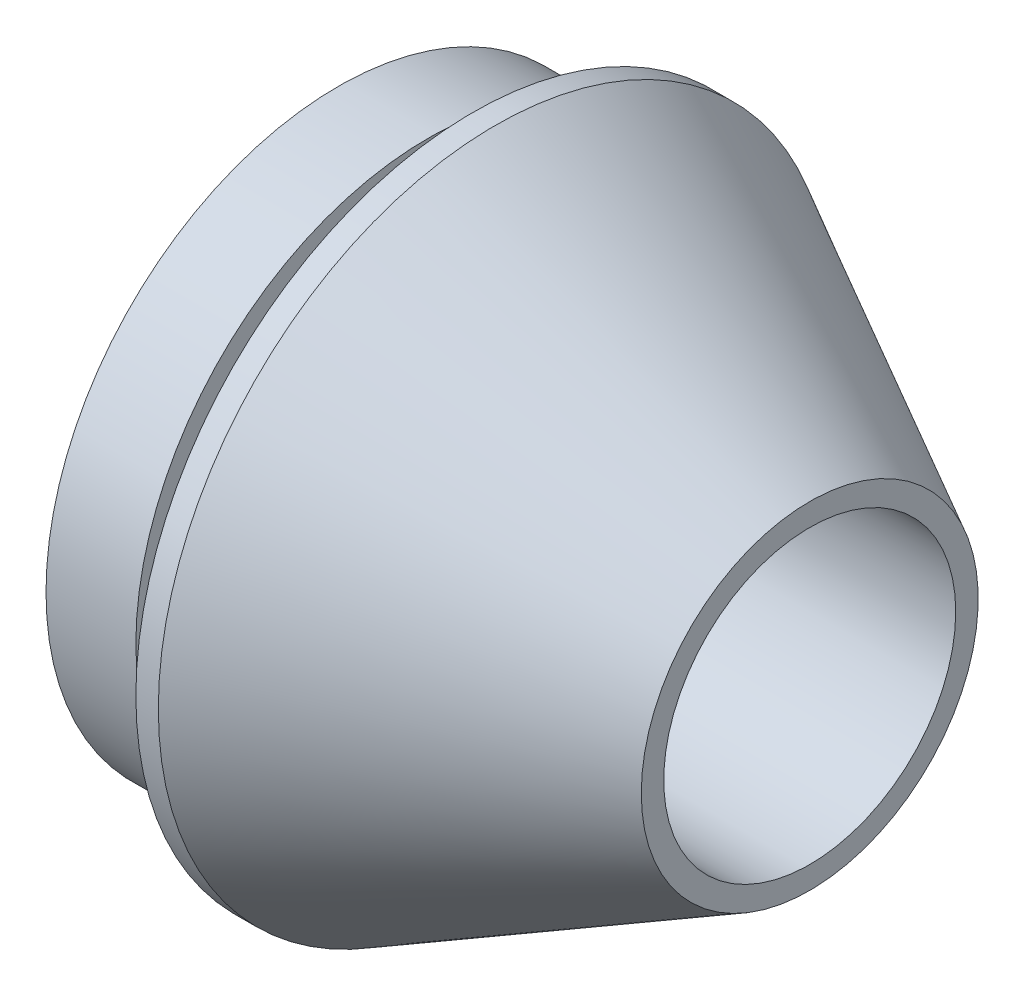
ISO-10303-21;
HEADER;
FILE_DESCRIPTION(('STEP AP214'),'2;1');
FILE_NAME('part.step','',(''),(''),'','','');
FILE_SCHEMA(('AUTOMOTIVE_DESIGN { 1 0 10303 214 1 1 1 1 }'));
ENDSEC;
DATA;
#1=APPLICATION_CONTEXT('core data for automotive mechanical design processes');
#2=APPLICATION_PROTOCOL_DEFINITION('international standard','automotive_design',2000,#1);
#3=PRODUCT_CONTEXT('',#1,'mechanical');
#4=PRODUCT('Part','Part','',(#3));
#5=PRODUCT_RELATED_PRODUCT_CATEGORY('part','',(#4));
#6=PRODUCT_DEFINITION_FORMATION('','',#4);
#7=PRODUCT_DEFINITION_CONTEXT('part definition',#1,'design');
#8=PRODUCT_DEFINITION('design','',#6,#7);
#9=PRODUCT_DEFINITION_SHAPE('','',#8);
#10=(LENGTH_UNIT() NAMED_UNIT(*) SI_UNIT(.MILLI.,.METRE.));
#11=(NAMED_UNIT(*) PLANE_ANGLE_UNIT() SI_UNIT($,.RADIAN.));
#12=(NAMED_UNIT(*) SI_UNIT($,.STERADIAN.) SOLID_ANGLE_UNIT());
#13=UNCERTAINTY_MEASURE_WITH_UNIT(LENGTH_MEASURE(1.E-05),#10,'distance_accuracy_value','');
#14=(GEOMETRIC_REPRESENTATION_CONTEXT(3) GLOBAL_UNCERTAINTY_ASSIGNED_CONTEXT((#13)) GLOBAL_UNIT_ASSIGNED_CONTEXT((#10,
#11,#12)) REPRESENTATION_CONTEXT('',''));
#15=CARTESIAN_POINT('',(0.,0.,0.));
#16=DIRECTION('',(0.,0.,1.));
#17=DIRECTION('',(1.,0.,0.));
#18=AXIS2_PLACEMENT_3D('',#15,#16,#17);
#19=CARTESIAN_POINT('',(21.,0.,0.));
#20=DIRECTION('',(-1.,0.,0.));
#21=DIRECTION('',(0.,0.,1.));
#22=AXIS2_PLACEMENT_3D('',#19,#20,#21);
#23=PLANE('',#22);
#24=CARTESIAN_POINT('',(21.,0.,0.));
#25=DIRECTION('',(1.,0.,0.));
#26=DIRECTION('',(0.,0.,-1.));
#27=AXIS2_PLACEMENT_3D('',#24,#25,#26);
#28=CIRCLE('',#27,6.5);
#29=CARTESIAN_POINT('',(21.,0.,-6.5));
#30=VERTEX_POINT('',#29);
#31=EDGE_CURVE('E61',#30,#30,#28,.T.);
#32=ORIENTED_EDGE('',*,*,#31,.F.);
#33=EDGE_LOOP('',(#32));
#34=FACE_BOUND('',#33,.T.);
#35=CARTESIAN_POINT('',(21.,0.,0.));
#36=DIRECTION('',(-1.,0.,0.));
#37=DIRECTION('',(0.,0.,1.));
#38=AXIS2_PLACEMENT_3D('',#35,#36,#37);
#39=CIRCLE('',#38,7.5);
#40=CARTESIAN_POINT('',(21.,0.,7.5));
#41=VERTEX_POINT('',#40);
#42=EDGE_CURVE('E10',#41,#41,#39,.T.);
#43=ORIENTED_EDGE('',*,*,#42,.F.);
#44=EDGE_LOOP('',(#43));
#45=FACE_BOUND('',#44,.T.);
#46=ADVANCED_FACE('F32',(#34,#45),#23,.F.);
#47=CARTESIAN_POINT('',(21.,0.,0.));
#48=DIRECTION('',(-1.,0.,0.));
#49=DIRECTION('',(0.,0.,1.));
#50=AXIS2_PLACEMENT_3D('',#47,#48,#49);
#51=CONICAL_SURFACE('',#50,7.5,0.491809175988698);
#52=CARTESIAN_POINT('',(7.,0.,0.));
#53=DIRECTION('',(-1.,0.,0.));
#54=DIRECTION('',(0.,0.,1.));
#55=AXIS2_PLACEMENT_3D('',#52,#53,#54);
#56=CIRCLE('',#55,15.);
#57=CARTESIAN_POINT('',(7.,0.,15.));
#58=VERTEX_POINT('',#57);
#59=EDGE_CURVE('E38',#58,#58,#56,.T.);
#60=ORIENTED_EDGE('',*,*,#59,.F.);
#61=EDGE_LOOP('',(#60));
#62=FACE_BOUND('',#61,.T.);
#63=ORIENTED_EDGE('',*,*,#42,.T.);
#64=EDGE_LOOP('',(#63));
#65=FACE_BOUND('',#64,.T.);
#66=ADVANCED_FACE('F78',(#62,#65),#51,.T.);
#67=CARTESIAN_POINT('',(0.,0.,0.));
#68=DIRECTION('',(-1.,0.,0.));
#69=DIRECTION('',(0.,0.,1.));
#70=AXIS2_PLACEMENT_3D('',#67,#68,#69);
#71=CYLINDRICAL_SURFACE('',#70,15.);
#72=CARTESIAN_POINT('',(6.,0.,0.));
#73=DIRECTION('',(-1.,0.,0.));
#74=DIRECTION('',(0.,0.,1.));
#75=AXIS2_PLACEMENT_3D('',#72,#73,#74);
#76=CIRCLE('',#75,15.);
#77=CARTESIAN_POINT('',(6.,0.,15.));
#78=VERTEX_POINT('',#77);
#79=EDGE_CURVE('E42',#78,#78,#76,.T.);
#80=ORIENTED_EDGE('',*,*,#79,.F.);
#81=EDGE_LOOP('',(#80));
#82=FACE_BOUND('',#81,.T.);
#83=ORIENTED_EDGE('',*,*,#59,.T.);
#84=EDGE_LOOP('',(#83));
#85=FACE_BOUND('',#84,.T.);
#86=ADVANCED_FACE('F82',(#82,#85),#71,.T.);
#87=CARTESIAN_POINT('',(6.,15.,0.));
#88=DIRECTION('',(1.,0.,0.));
#89=DIRECTION('',(0.,0.,-1.));
#90=AXIS2_PLACEMENT_3D('',#87,#88,#89);
#91=PLANE('',#90);
#92=CARTESIAN_POINT('',(6.,0.,0.));
#93=DIRECTION('',(-1.,0.,0.));
#94=DIRECTION('',(0.,0.,1.));
#95=AXIS2_PLACEMENT_3D('',#92,#93,#94);
#96=CIRCLE('',#95,12.);
#97=CARTESIAN_POINT('',(6.,0.,12.));
#98=VERTEX_POINT('',#97);
#99=EDGE_CURVE('E46',#98,#98,#96,.T.);
#100=ORIENTED_EDGE('',*,*,#99,.F.);
#101=EDGE_LOOP('',(#100));
#102=FACE_BOUND('',#101,.T.);
#103=ORIENTED_EDGE('',*,*,#79,.T.);
#104=EDGE_LOOP('',(#103));
#105=FACE_BOUND('',#104,.T.);
#106=ADVANCED_FACE('F87',(#102,#105),#91,.F.);
#107=CARTESIAN_POINT('',(0.,0.,0.));
#108=DIRECTION('',(-1.,0.,0.));
#109=DIRECTION('',(0.,0.,1.));
#110=AXIS2_PLACEMENT_3D('',#107,#108,#109);
#111=CYLINDRICAL_SURFACE('',#110,12.);
#112=CARTESIAN_POINT('',(4.,0.,0.));
#113=DIRECTION('',(-1.,0.,0.));
#114=DIRECTION('',(0.,0.,1.));
#115=AXIS2_PLACEMENT_3D('',#112,#113,#114);
#116=CIRCLE('',#115,12.);
#117=CARTESIAN_POINT('',(4.,0.,12.));
#118=VERTEX_POINT('',#117);
#119=EDGE_CURVE('E51',#118,#118,#116,.T.);
#120=ORIENTED_EDGE('',*,*,#119,.F.);
#121=EDGE_LOOP('',(#120));
#122=FACE_BOUND('',#121,.T.);
#123=ORIENTED_EDGE('',*,*,#99,.T.);
#124=EDGE_LOOP('',(#123));
#125=FACE_BOUND('',#124,.T.);
#126=ADVANCED_FACE('F93',(#122,#125),#111,.T.);
#127=CARTESIAN_POINT('',(4.,13.,0.));
#128=DIRECTION('',(-1.,0.,0.));
#129=DIRECTION('',(0.,0.,1.));
#130=AXIS2_PLACEMENT_3D('',#127,#128,#129);
#131=PLANE('',#130);
#132=CARTESIAN_POINT('',(4.,0.,0.));
#133=DIRECTION('',(-1.,0.,0.));
#134=DIRECTION('',(0.,0.,1.));
#135=AXIS2_PLACEMENT_3D('',#132,#133,#134);
#136=CIRCLE('',#135,13.);
#137=CARTESIAN_POINT('',(4.,0.,13.));
#138=VERTEX_POINT('',#137);
#139=EDGE_CURVE('E54',#138,#138,#136,.T.);
#140=ORIENTED_EDGE('',*,*,#139,.F.);
#141=EDGE_LOOP('',(#140));
#142=FACE_BOUND('',#141,.T.);
#143=ORIENTED_EDGE('',*,*,#119,.T.);
#144=EDGE_LOOP('',(#143));
#145=FACE_BOUND('',#144,.T.);
#146=ADVANCED_FACE('F97',(#142,#145),#131,.F.);
#147=CARTESIAN_POINT('',(0.,0.,0.));
#148=DIRECTION('',(-1.,0.,0.));
#149=DIRECTION('',(0.,0.,1.));
#150=AXIS2_PLACEMENT_3D('',#147,#148,#149);
#151=CYLINDRICAL_SURFACE('',#150,13.);
#152=CARTESIAN_POINT('',(0.,0.,0.));
#153=DIRECTION('',(-1.,0.,0.));
#154=DIRECTION('',(0.,0.,1.));
#155=AXIS2_PLACEMENT_3D('',#152,#153,#154);
#156=CIRCLE('',#155,13.);
#157=CARTESIAN_POINT('',(0.,0.,13.));
#158=VERTEX_POINT('',#157);
#159=EDGE_CURVE('E57',#158,#158,#156,.T.);
#160=ORIENTED_EDGE('',*,*,#159,.F.);
#161=EDGE_LOOP('',(#160));
#162=FACE_BOUND('',#161,.T.);
#163=ORIENTED_EDGE('',*,*,#139,.T.);
#164=EDGE_LOOP('',(#163));
#165=FACE_BOUND('',#164,.T.);
#166=ADVANCED_FACE('F101',(#162,#165),#151,.T.);
#167=CARTESIAN_POINT('',(0.,0.,0.));
#168=DIRECTION('',(1.,0.,0.));
#169=DIRECTION('',(0.,0.,-1.));
#170=AXIS2_PLACEMENT_3D('',#167,#168,#169);
#171=PLANE('',#170);
#172=CARTESIAN_POINT('',(0.,0.,0.));
#173=DIRECTION('',(1.,0.,0.));
#174=DIRECTION('',(0.,0.,-1.));
#175=AXIS2_PLACEMENT_3D('',#172,#173,#174);
#176=CIRCLE('',#175,6.5);
#177=CARTESIAN_POINT('',(0.,0.,-6.5));
#178=VERTEX_POINT('',#177);
#179=EDGE_CURVE('E60',#178,#178,#176,.T.);
#180=ORIENTED_EDGE('',*,*,#179,.T.);
#181=EDGE_LOOP('',(#180));
#182=FACE_BOUND('',#181,.T.);
#183=ORIENTED_EDGE('',*,*,#159,.T.);
#184=EDGE_LOOP('',(#183));
#185=FACE_BOUND('',#184,.T.);
#186=ADVANCED_FACE('F67',(#182,#185),#171,.F.);
#187=CARTESIAN_POINT('',(0.,0.,0.));
#188=DIRECTION('',(1.,0.,0.));
#189=DIRECTION('',(0.,0.,-1.));
#190=AXIS2_PLACEMENT_3D('',#187,#188,#189);
#191=CYLINDRICAL_SURFACE('',#190,6.5);
#192=CARTESIAN_POINT('',(0.,0.,-6.5));
#193=CARTESIAN_POINT('',(0.21875,0.,-6.5));
#194=CARTESIAN_POINT('',(0.4375,0.,-6.5));
#195=CARTESIAN_POINT('',(0.875,0.,-6.5));
#196=CARTESIAN_POINT('',(1.09375,0.,-6.5));
#197=CARTESIAN_POINT('',(1.53125,0.,-6.5));
#198=CARTESIAN_POINT('',(1.75,0.,-6.5));
#199=CARTESIAN_POINT('',(2.1875,0.,-6.5));
#200=CARTESIAN_POINT('',(2.40625,0.,-6.5));
#201=CARTESIAN_POINT('',(2.84375,0.,-6.5));
#202=CARTESIAN_POINT('',(3.0625,0.,-6.5));
#203=CARTESIAN_POINT('',(3.5,0.,-6.5));
#204=CARTESIAN_POINT('',(3.71875,0.,-6.5));
#205=CARTESIAN_POINT('',(4.15625,0.,-6.5));
#206=CARTESIAN_POINT('',(4.375,0.,-6.5));
#207=CARTESIAN_POINT('',(4.8125,0.,-6.5));
#208=CARTESIAN_POINT('',(5.03125,0.,-6.5));
#209=CARTESIAN_POINT('',(5.46875,0.,-6.5));
#210=CARTESIAN_POINT('',(5.6875,0.,-6.5));
#211=CARTESIAN_POINT('',(6.125,0.,-6.5));
#212=CARTESIAN_POINT('',(6.34375,0.,-6.5));
#213=CARTESIAN_POINT('',(6.78125,0.,-6.5));
#214=CARTESIAN_POINT('',(7.,0.,-6.5));
#215=CARTESIAN_POINT('',(7.4375,0.,-6.5));
#216=CARTESIAN_POINT('',(7.65625,0.,-6.5));
#217=CARTESIAN_POINT('',(8.09375,0.,-6.5));
#218=CARTESIAN_POINT('',(8.3125,0.,-6.5));
#219=CARTESIAN_POINT('',(8.75,0.,-6.5));
#220=CARTESIAN_POINT('',(8.96875,0.,-6.5));
#221=CARTESIAN_POINT('',(9.40625,0.,-6.5));
#222=CARTESIAN_POINT('',(9.625,0.,-6.5));
#223=CARTESIAN_POINT('',(10.0625,0.,-6.5));
#224=CARTESIAN_POINT('',(10.28125,0.,-6.5));
#225=CARTESIAN_POINT('',(10.71875,0.,-6.5));
#226=CARTESIAN_POINT('',(10.9375,0.,-6.5));
#227=CARTESIAN_POINT('',(11.375,0.,-6.5));
#228=CARTESIAN_POINT('',(11.59375,0.,-6.5));
#229=CARTESIAN_POINT('',(12.03125,0.,-6.5));
#230=CARTESIAN_POINT('',(12.25,0.,-6.5));
#231=CARTESIAN_POINT('',(12.6875,0.,-6.5));
#232=CARTESIAN_POINT('',(12.90625,0.,-6.5));
#233=CARTESIAN_POINT('',(13.34375,0.,-6.5));
#234=CARTESIAN_POINT('',(13.5625,0.,-6.5));
#235=CARTESIAN_POINT('',(14.,0.,-6.5));
#236=CARTESIAN_POINT('',(14.21875,0.,-6.5));
#237=CARTESIAN_POINT('',(14.65625,0.,-6.5));
#238=CARTESIAN_POINT('',(14.875,0.,-6.5));
#239=CARTESIAN_POINT('',(15.3125,0.,-6.5));
#240=CARTESIAN_POINT('',(15.53125,0.,-6.5));
#241=CARTESIAN_POINT('',(15.96875,0.,-6.5));
#242=CARTESIAN_POINT('',(16.1875,0.,-6.5));
#243=CARTESIAN_POINT('',(16.625,0.,-6.5));
#244=CARTESIAN_POINT('',(16.84375,0.,-6.5));
#245=CARTESIAN_POINT('',(17.28125,0.,-6.5));
#246=CARTESIAN_POINT('',(17.5,0.,-6.5));
#247=CARTESIAN_POINT('',(17.9375,0.,-6.5));
#248=CARTESIAN_POINT('',(18.15625,0.,-6.5));
#249=CARTESIAN_POINT('',(18.59375,0.,-6.5));
#250=CARTESIAN_POINT('',(18.8125,0.,-6.5));
#251=CARTESIAN_POINT('',(19.25,0.,-6.5));
#252=CARTESIAN_POINT('',(19.46875,0.,-6.5));
#253=CARTESIAN_POINT('',(19.90625,0.,-6.5));
#254=CARTESIAN_POINT('',(20.125,0.,-6.5));
#255=CARTESIAN_POINT('',(20.5625,0.,-6.5));
#256=CARTESIAN_POINT('',(20.78125,0.,-6.5));
#257=CARTESIAN_POINT('',(21.,0.,-6.5));
#258=B_SPLINE_CURVE_WITH_KNOTS('',3,(#192,#193,#194,#195,#196,#197,#198,#199,#200,#201,#202,
#203,#204,#205,#206,#207,#208,#209,#210,#211,#212,#213,#214,#215,#216,#217,#218,#219,#220,#221,
#222,#223,#224,#225,#226,#227,#228,#229,#230,#231,#232,#233,#234,#235,#236,#237,#238,#239,#240,
#241,#242,#243,#244,#245,#246,#247,#248,#249,#250,#251,#252,#253,#254,#255,#256,#257),
.UNSPECIFIED.,.F.,.F.,(4,2,2,2,2,2,2,2,2,2,2,2,2,2,2,2,2,2,2,2,2,2,2,2,2,2,2,2,2,2,2,2,4),(0.,
0.65625,1.3125,1.96875,2.625,3.28125,3.9375,4.59375,5.25,5.90625,6.5625,7.21875,7.875,8.53125,
9.1875,9.84375,10.5,11.15625,11.8125,12.46875,13.125,13.78125,14.4375,15.09375,15.75,16.40625,
17.0625,17.71875,18.375,19.03125,19.6875,20.34375,21.),.UNSPECIFIED.);
#259=EDGE_CURVE('BSEAM70',#178,#30,#258,.T.);
#260=ORIENTED_EDGE('',*,*,#179,.F.);
#261=ORIENTED_EDGE('',*,*,#31,.T.);
#262=ORIENTED_EDGE('',*,*,#259,.T.);
#263=ORIENTED_EDGE('',*,*,#259,.F.);
#264=EDGE_LOOP('',(#260,#262,#261,#263));
#265=FACE_BOUND('',#264,.T.);
#266=ADVANCED_FACE('F70',(#265),#191,.F.);
#267=CLOSED_SHELL('',(#46,#66,#86,#106,#126,#146,#166,#186,#266));
#268=MANIFOLD_SOLID_BREP('B2',#267);
#269=ADVANCED_BREP_SHAPE_REPRESENTATION('',(#18,#268),#14);
#270=SHAPE_DEFINITION_REPRESENTATION(#9,#269);
ENDSEC;
END-ISO-10303-21;
